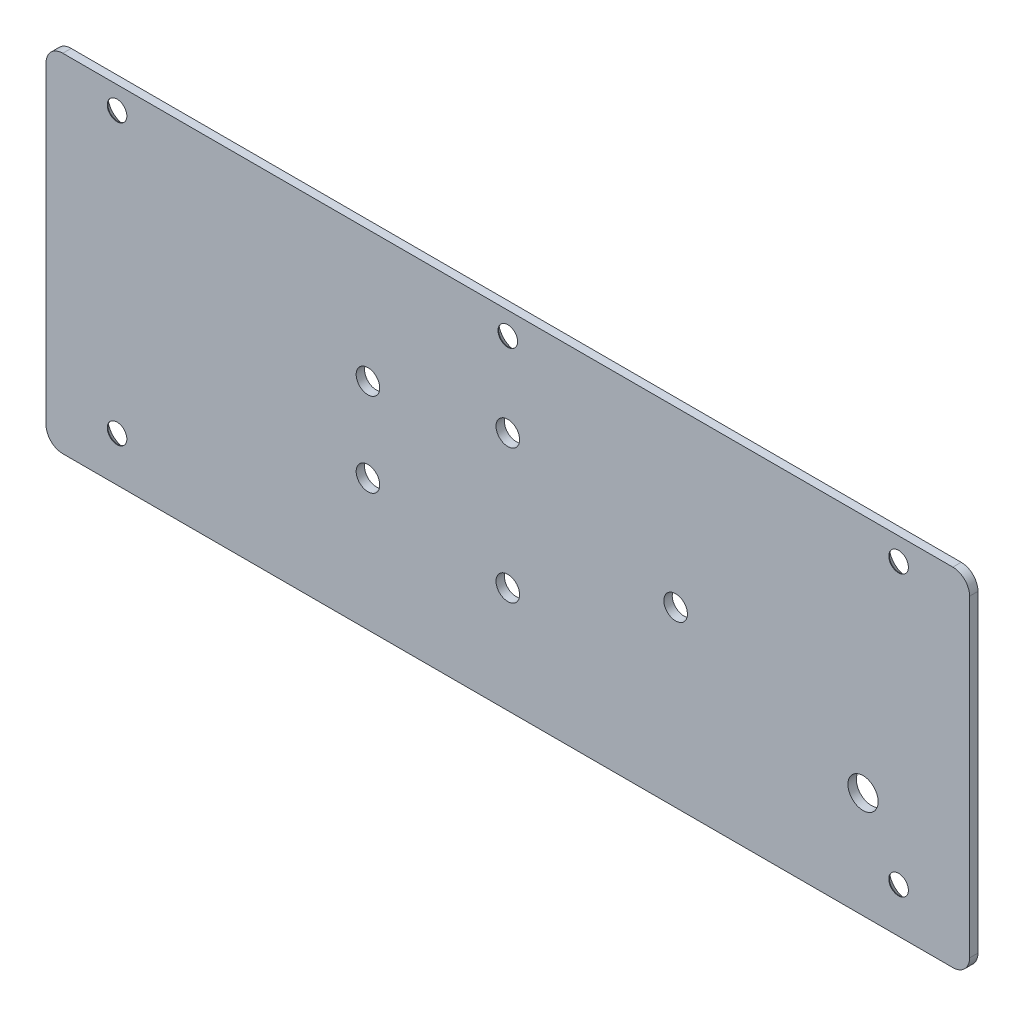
from build123d import *

# Parameters (mm, degrees)
SKETCH1_W           = 1.5
SKETCH1_H           = 62
EXTRUDE_THIN1_DEPTH = 165.1
SKETCH3_R           = 2.1082
CUT_EXTRUDE2_DEPTH  = 177.363998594
SKETCH4_R           = 1.75
CUT_EXTRUDE3_DEPTH  = 177.363998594
CUT_EXTRUDE4_REACH  = 178.364
SKETCH5_R           = 2.7
BOSS_EXTRUDE1_START = 0.01
SKETCH6_R           = 5
SKETCH6_R_2         = 2.7
BOSS_EXTRUDE1_DEPTH = 0.01
CHAMFER1_SIZE       = 1.4
FILLET1_R           = 3


with BuildPart() as part:
    # Sketch1 → Extrude-Thin1 (new body)
    with BuildSketch(Plane(origin=(0, 0, 0), x_dir=(0, 0, -1), z_dir=(1, 0, 0))):
        with Locations((-0.75, 31)):
            Rectangle(SKETCH1_W, SKETCH1_H)
    extrude(amount=-EXTRUDE_THIN1_DEPTH)

    # Sketch3 → Cut-Extrude2 (cut, through all)
    with BuildSketch(Plane(origin=(0, 0, 0), x_dir=(-1, 0, 0), z_dir=(0, 0, -1))):
        with Locations(Location((82.55, 43, 0), (0, 0, 90))):
            Circle(SKETCH3_R)
        with Locations(Location((82.55, 19, 0), (0, 0, 90))):
            Circle(SKETCH3_R)
        with Locations(Location((107.55, 38.5, 0), (0, 0, 90))):
            Circle(SKETCH3_R)
        with Locations(Location((107.55, 23.5, 0), (0, 0, 90))):
            Circle(SKETCH3_R)
        with Locations(Location((52.55, 31, 0), (0, 0, 90))):
            Circle(SKETCH3_R)
    extrude(amount=-CUT_EXTRUDE2_DEPTH, mode=Mode.SUBTRACT)

    # Sketch4 → Cut-Extrude3 (cut, through all)
    with BuildSketch(Plane.XY.offset(1.5)):
        with Locations((-152.4, 58)):
            Circle(SKETCH4_R)
        with Locations((-12.7, 58)):
            Circle(SKETCH4_R)
        with Locations((-12.7, 8)):
            Circle(SKETCH4_R)
        with Locations((-152.4, 8)):
            Circle(SKETCH4_R)
        with Locations((-82.55, 58)):
            Circle(SKETCH4_R)
    extrude(amount=-CUT_EXTRUDE3_DEPTH, mode=Mode.SUBTRACT)

    # Sketch5 → Cut-Extrude4 (cut, up to next)
    with BuildSketch(Plane(origin=(0, 0, 0), x_dir=(-1, 0, 0), z_dir=(0, 0, -1)), mode=Mode.PRIVATE) as cut_extrude4_sk1:
        with Locations(Location((19.05, 19, 0), (0, 0, 90))):
            Circle(SKETCH5_R)
    cut_extrude4_tool1 = extrude(cut_extrude4_sk1.sketch, amount=-CUT_EXTRUDE4_REACH, mode=Mode.PRIVATE) & part.part
    add(cut_extrude4_tool1.solids().sort_by_distance((-19.05, 19, 0))[0], mode=Mode.SUBTRACT)

    # Sketch6 → Boss-Extrude1 (add)
    with BuildSketch(Plane(origin=(0, 0, 0), x_dir=(-1, 0, 0), z_dir=(0, 0, -1)).offset(BOSS_EXTRUDE1_START)):
        with Locations(Location((19.05, 19, 0), (0, 0, 270))):
            Circle(SKETCH6_R)
        with Locations(Location((19.05, 19, 0), (0, 0, 90))):
            Circle(SKETCH6_R_2, mode=Mode.SUBTRACT)
    extrude(amount=-BOSS_EXTRUDE1_DEPTH)

    # Chamfer1
    chamfer1_edges = [part.edges().sort_by_distance(p)[0] for p in [
        (-154.15, 8, 0),
        (-14.45, 8, 0),
        (-14.45, 58, 0),
        (-154.15, 58, 0),
        (-84.3, 58, 0),
    ]]
    chamfer(chamfer1_edges, length=CHAMFER1_SIZE)

    # Fillet1
    fillet1_edges = [part.edges().sort_by_distance(p)[0] for p in [
        (-165.1, 0, 0.75),
        (0, 0, 0.75),
        (0, 62, 0.75),
        (-165.1, 62, 0.75),
    ]]
    fillet(fillet1_edges, radius=FILLET1_R)


solid = part.part
